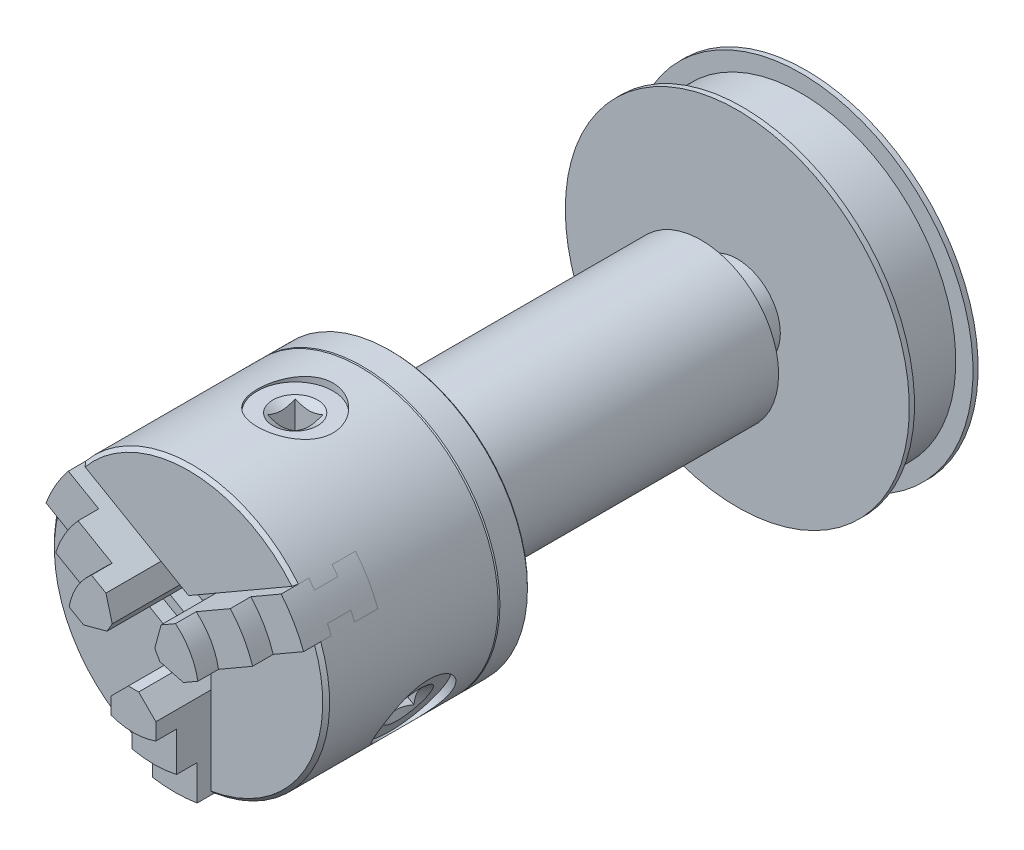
from build123d import *

# Parameters (mm, degrees)
SKETCH1_R            = 22.5
BOSS_EXTRUDE1_DEPTH  = 80
SKETCH2_R            = 12.5
BOSS_EXTRUDE2_DEPTH  = 10.5
SKETCH3_R            = 50
BOSS_EXTRUDE3_DEPTH  = 1.5
SKETCH4_R            = 45
BOSS_EXTRUDE4_DEPTH  = 17
SKETCH5_R            = 50
BOSS_EXTRUDE5_DEPTH  = 1.5
SKETCH6_R            = 12.5
BOSS_EXTRUDE6_DEPTH  = 1.5
SKETCH7_R            = 6
BOSS_EXTRUDE7_DEPTH  = 8
BOSS_EXTRUDE8_START  = 2
SKETCH8_R            = 12.5
BOSS_EXTRUDE8_DEPTH  = 2
SKETCH9_R            = 22.5
BOSS_EXTRUDE9_DEPTH  = 8
SKETCH10_R           = 40
BOSS_EXTRUDE10_DEPTH = 9
CHAMFER1_SIZE        = 0.5
SKETCH11_R           = 40
BOSS_EXTRUDE11_DEPTH = 50
CHAMFER2_SIZE        = 1
CUT_EXTRUDE1_START   = 38
SKETCH12_R           = 11
CUT_EXTRUDE1_DEPTH   = 127.927256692
SKETCH13_W           = 8
SKETCH13_H           = 8
CUT_EXTRUDE2_DEPTH   = 13
CIRPATTERN1_COUNT    = 3
CUT_EXTRUDE4_DEPTH   = 165.927256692
CIRPATTERN2_COUNT    = 3
BOSS_EXTRUDE12_START = -8
BOSS_EXTRUDE12_DEPTH = 32
CHAMFER3_SIZE        = 5
CIRPATTERN6_COUNT    = 3
SKETCH18_R           = 56.962173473
SKETCH18_R_2         = 19
CUT_EXTRUDE5_DEPTH   = 6
SKETCH20_R           = 66.142717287
SKETCH20_R_2         = 30
CUT_EXTRUDE6_DEPTH   = 6
CUT_EXTRUDE7_START   = -25
SKETCH21_R           = 72.147326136
SKETCH21_R_2         = 40
CUT_EXTRUDE7_DEPTH   = 25


with BuildPart() as part:
    # Sketch1 → Boss-Extrude1 (new body)
    with BuildSketch(Plane.XY):
        Circle(SKETCH1_R)
    extrude(amount=BOSS_EXTRUDE1_DEPTH)

    # Sketch2 → Boss-Extrude2 (add)
    with BuildSketch(Plane(origin=(0, 0, 0), x_dir=(-1, 0, 0), z_dir=(0, 0, -1))):
        with Locations(Location((0, 0, 0), (0, 0, 180))):
            Circle(SKETCH2_R)
    extrude(amount=BOSS_EXTRUDE2_DEPTH)

    # Sketch3 → Boss-Extrude3 (add)
    with BuildSketch(Plane(origin=(0, 0, -10.5), x_dir=(-1, 0, 0), z_dir=(0, 0, -1))):
        Circle(SKETCH3_R)
    extrude(amount=BOSS_EXTRUDE3_DEPTH)

    # Sketch4 → Boss-Extrude4 (add)
    with BuildSketch(Plane(origin=(0, 0, -12), x_dir=(-1, 0, 0), z_dir=(0, 0, -1))):
        Circle(SKETCH4_R)
    extrude(amount=BOSS_EXTRUDE4_DEPTH)

    # Sketch5 → Boss-Extrude5 (add)
    with BuildSketch(Plane(origin=(0, 0, -29), x_dir=(-1, 0, 0), z_dir=(0, 0, -1))):
        Circle(SKETCH5_R)
    extrude(amount=BOSS_EXTRUDE5_DEPTH)

    # Sketch8 → Boss-Extrude8 (add)
    with BuildSketch(Plane.XY.offset(80).offset(BOSS_EXTRUDE8_START)):
        with Locations(Location((0, 0, 0), (0, 0, 180))):
            Circle(SKETCH8_R)
    extrude(amount=-BOSS_EXTRUDE8_DEPTH)

    # Sketch9 → Boss-Extrude9 (add)
    with BuildSketch(Plane.XY.offset(82)):
        Circle(SKETCH9_R)
    extrude(amount=BOSS_EXTRUDE9_DEPTH)

    # Sketch10 → Boss-Extrude10 (add)
    with BuildSketch(Plane.XY.offset(90)):
        Circle(SKETCH10_R)
    extrude(amount=BOSS_EXTRUDE10_DEPTH)

    # Chamfer1
    chamfer1_edges = [part.edges().sort_by_distance(p)[0] for p in [
        (-40, 0, 90),
        (-40, 0, 99),
    ]]
    chamfer(chamfer1_edges, length=CHAMFER1_SIZE)

    # Sketch11 → Boss-Extrude11 (add)
    with BuildSketch(Plane.XY.offset(99)):
        Circle(SKETCH11_R)
    extrude(amount=BOSS_EXTRUDE11_DEPTH)

    # Chamfer2
    chamfer2_edges = [part.edges().sort_by_distance(p)[0] for p in [
        (-40, 0, 149),
    ]]
    chamfer(chamfer2_edges, length=CHAMFER2_SIZE)

    # Sketch12 → Cut-Extrude1 (cut, through all)
    with BuildSketch(Plane(origin=(0, 0, 0), x_dir=(1, 0, 0), z_dir=(0, 1, 0)).offset(CUT_EXTRUDE1_START)):
        with Locations(Location((0, -118, 0), (0, 0, 90))):
            Circle(SKETCH12_R)
    cut_extrude1 = extrude(amount=CUT_EXTRUDE1_DEPTH, mode=Mode.SUBTRACT)

    # Sketch13 → Cut-Extrude2 (cut)
    with BuildSketch(Plane(origin=(0, 38, 0), x_dir=(1, 0, 0), z_dir=(0, 1, 0))):
        with Locations((0, -118)):
            Rectangle(SKETCH13_W, SKETCH13_H)
    cut_extrude2 = extrude(amount=-CUT_EXTRUDE2_DEPTH, mode=Mode.SUBTRACT)

    # Cut-Extrude3 cone 1 section (on through the dimple's axis) → Cut-Extrude3 (revolve, cut)
    with BuildSketch(Plane(origin=(0, 38, 118), x_dir=(0, 0, 1), z_dir=(1, 0, 0))):
        Polygon((0, 0), (6.5, 0), (0, 3.75277675), align=None)
    cut_extrude3 = revolve(axis=Axis((0, 38, 118), (0, -1, 0)), mode=Mode.SUBTRACT)

    # CirPattern1: Cut-Extrude1, Cut-Extrude2, Cut-Extrude3 ×3 about axis
    cirpattern1_axis = Axis((0, 0, 0), (0, 0, 1))
    add([cut_extrude1.rotate(cirpattern1_axis, i * 360 / CIRPATTERN1_COUNT) for i in range(1, CIRPATTERN1_COUNT)], mode=Mode.SUBTRACT)
    add([cut_extrude2.rotate(cirpattern1_axis, i * 360 / CIRPATTERN1_COUNT) for i in range(1, CIRPATTERN1_COUNT)], mode=Mode.SUBTRACT)
    add([cut_extrude3.rotate(cirpattern1_axis, i * 360 / CIRPATTERN1_COUNT) for i in range(1, CIRPATTERN1_COUNT)], mode=Mode.SUBTRACT)

    # Sketch16 → Cut-Extrude4 (cut, through all)
    with BuildSketch(Plane(origin=(0, 0, 0), x_dir=(1, 0, 0), z_dir=(0, 1, 0))):
        Polygon((-6.5, -153), (-3.767510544, -153), (-3.767510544, -155.2), (3.767510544, -155.2), (3.767510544, -153), (6.5, -153), (6.5, -145), (3.767510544, -145), (3.767510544, -138.2), (6.5, -138.2), (6.5, -131.4), (-6.5, -131.4), (-6.5, -138.2), (-3.767510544, -138.2), (-3.767510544, -145), (-6.5, -145), align=None)
    cut_extrude4 = extrude(amount=-CUT_EXTRUDE4_DEPTH, mode=Mode.SUBTRACT)

    # CirPattern2: Cut-Extrude4 ×3 about axis
    cirpattern2_axis = Axis((0, 0, 0), (0, 0, 1))
    for i in range(1, CIRPATTERN2_COUNT):
        add(cut_extrude4.rotate(cirpattern2_axis, i * 360 / CIRPATTERN2_COUNT), mode=Mode.SUBTRACT)


with BuildPart() as body_2:
    # Sketch6 → Boss-Extrude6 (new body)
    with BuildSketch(Plane(origin=(0, 0, -30.5), x_dir=(-1, 0, 0), z_dir=(0, 0, -1))):
        Circle(SKETCH6_R)
    extrude(amount=BOSS_EXTRUDE6_DEPTH)


with BuildPart() as body_3:
    # Sketch7 → Boss-Extrude7 (new body)
    with BuildSketch(Plane(origin=(0, 0, -32), x_dir=(-1, 0, 0), z_dir=(0, 0, -1))):
        Circle(SKETCH7_R)
    extrude(amount=BOSS_EXTRUDE7_DEPTH)


with BuildPart() as body_4:
    # Sketch17 → Boss-Extrude12 (new body)
    with BuildSketch(Plane(origin=(0, 0, 0), x_dir=(1, 0, 0), z_dir=(0, 1, 0)).offset(BOSS_EXTRUDE12_START)):
        Polygon((-6.5, -165), (6.5, -165), (6.5, -145), (3.767510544, -145), (3.767510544, -138.2), (6.5, -138.2), (6.5, -131.4), (-6.5, -131.4), (-6.5, -138.2), (-3.767510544, -138.2), (-3.767510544, -145), (-6.5, -145), align=None)
    extrude(amount=-BOSS_EXTRUDE12_DEPTH)

    # Chamfer3
    chamfer3_edges = [body_4.edges().sort_by_distance(p)[0] for p in [
        (-6.5, -8, 155),
        (6.5, -8, 155),
    ]]
    chamfer(chamfer3_edges, length=CHAMFER3_SIZE)


with BuildPart() as cirpattern6_1:
    # CirPattern6: pattern copy
    add(body_4.part.rotate(Axis((0, 0, 0), (0, 0, 1)), 1 * 360 / CIRPATTERN6_COUNT))


with BuildPart() as cirpattern6_2:
    # CirPattern6: pattern copy
    add(body_4.part.rotate(Axis((0, 0, 0), (0, 0, 1)), 2 * 360 / CIRPATTERN6_COUNT))


with BuildPart() as cut_extrude5_tool:
    # Sketch18 → Cut-Extrude5 (new body)
    with BuildSketch(Plane.XY.offset(165)):
        Circle(SKETCH18_R)
        Circle(SKETCH18_R_2, mode=Mode.SUBTRACT)
    extrude(amount=-CUT_EXTRUDE5_DEPTH)


with BuildPart() as body_4_1:
    add(body_4.part)

    # Cut-Extrude5: cut by cut_extrude5_tool
    add(cut_extrude5_tool.part, mode=Mode.SUBTRACT)


with BuildPart() as cirpattern6_1_1:
    add(cirpattern6_1.part)

    # Cut-Extrude5: cut by cut_extrude5_tool
    add(cut_extrude5_tool.part, mode=Mode.SUBTRACT)


with BuildPart() as cirpattern6_2_1:
    add(cirpattern6_2.part)

    # Cut-Extrude5: cut by cut_extrude5_tool
    add(cut_extrude5_tool.part, mode=Mode.SUBTRACT)


with BuildPart() as cut_extrude6_tool:
    # Sketch20 → Cut-Extrude6 (new body)
    with BuildSketch(Plane.XY.offset(159)):
        Circle(SKETCH20_R)
        Circle(SKETCH20_R_2, mode=Mode.SUBTRACT)
    extrude(amount=-CUT_EXTRUDE6_DEPTH)


with BuildPart() as body_4_2:
    add(body_4_1.part)

    # Cut-Extrude6: cut by cut_extrude6_tool
    add(cut_extrude6_tool.part, mode=Mode.SUBTRACT)


with BuildPart() as cirpattern6_1_2:
    add(cirpattern6_1_1.part)

    # Cut-Extrude6: cut by cut_extrude6_tool
    add(cut_extrude6_tool.part, mode=Mode.SUBTRACT)


with BuildPart() as cirpattern6_2_2:
    add(cirpattern6_2_1.part)

    # Cut-Extrude6: cut by cut_extrude6_tool
    add(cut_extrude6_tool.part, mode=Mode.SUBTRACT)


with BuildPart() as cut_extrude7_tool:
    # Sketch21 → Cut-Extrude7 (new body)
    with BuildSketch(Plane.XY.offset(153).offset(CUT_EXTRUDE7_START)):
        Circle(SKETCH21_R)
        with Locations(Location((0, 0, 0), (0, 0, 159.352035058))):
            Circle(SKETCH21_R_2, mode=Mode.SUBTRACT)
    extrude(amount=CUT_EXTRUDE7_DEPTH)


with BuildPart() as body_4_3:
    add(body_4_2.part)

    # Cut-Extrude7: cut by cut_extrude7_tool
    add(cut_extrude7_tool.part, mode=Mode.SUBTRACT)


with BuildPart() as cirpattern6_1_3:
    add(cirpattern6_1_2.part)

    # Cut-Extrude7: cut by cut_extrude7_tool
    add(cut_extrude7_tool.part, mode=Mode.SUBTRACT)


with BuildPart() as cirpattern6_2_3:
    add(cirpattern6_2_2.part)

    # Cut-Extrude7: cut by cut_extrude7_tool
    add(cut_extrude7_tool.part, mode=Mode.SUBTRACT)


solid = Compound([part.part, body_2.part, body_3.part, body_4_3.part, cirpattern6_1_3.part, cirpattern6_2_3.part])
